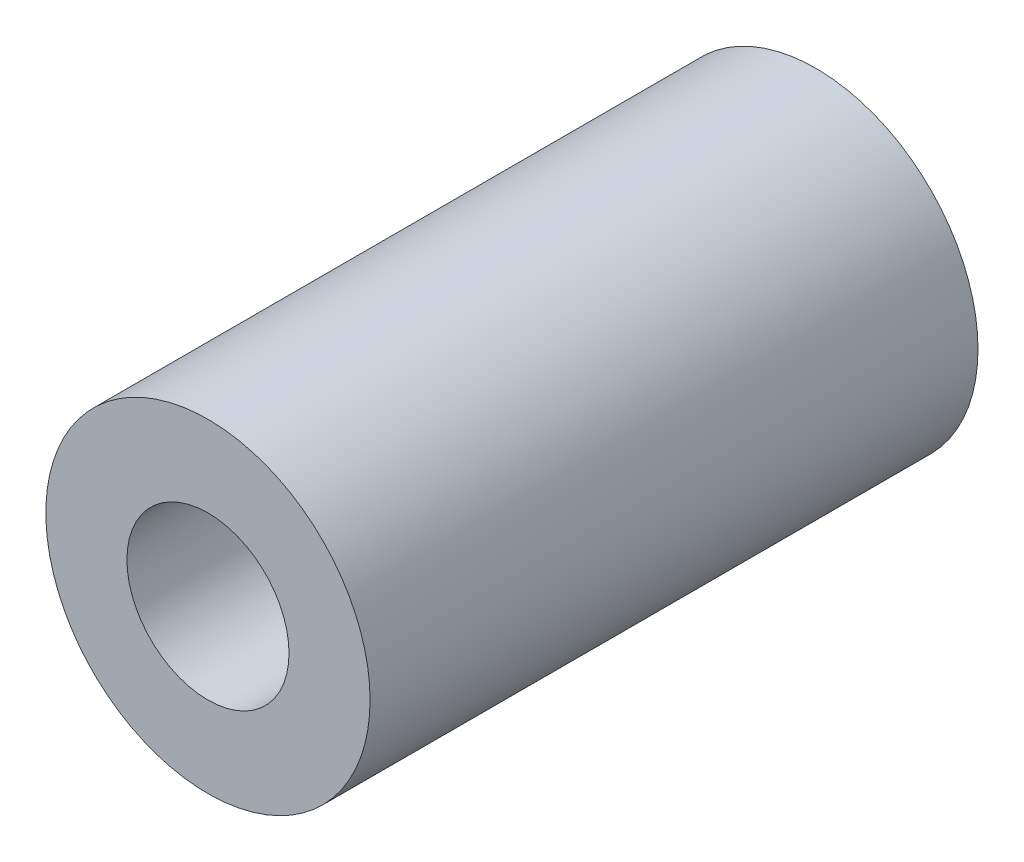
ISO-10303-21;
HEADER;
FILE_DESCRIPTION(('STEP AP214'),'2;1');
FILE_NAME('part.step','',(''),(''),'','','');
FILE_SCHEMA(('AUTOMOTIVE_DESIGN { 1 0 10303 214 1 1 1 1 }'));
ENDSEC;
DATA;
#1=APPLICATION_CONTEXT('core data for automotive mechanical design processes');
#2=APPLICATION_PROTOCOL_DEFINITION('international standard','automotive_design',2000,#1);
#3=PRODUCT_CONTEXT('',#1,'mechanical');
#4=PRODUCT('Part','Part','',(#3));
#5=PRODUCT_RELATED_PRODUCT_CATEGORY('part','',(#4));
#6=PRODUCT_DEFINITION_FORMATION('','',#4);
#7=PRODUCT_DEFINITION_CONTEXT('part definition',#1,'design');
#8=PRODUCT_DEFINITION('design','',#6,#7);
#9=PRODUCT_DEFINITION_SHAPE('','',#8);
#10=(LENGTH_UNIT() NAMED_UNIT(*) SI_UNIT(.MILLI.,.METRE.));
#11=(NAMED_UNIT(*) PLANE_ANGLE_UNIT() SI_UNIT($,.RADIAN.));
#12=(NAMED_UNIT(*) SI_UNIT($,.STERADIAN.) SOLID_ANGLE_UNIT());
#13=UNCERTAINTY_MEASURE_WITH_UNIT(LENGTH_MEASURE(1.E-05),#10,'distance_accuracy_value','');
#14=(GEOMETRIC_REPRESENTATION_CONTEXT(3) GLOBAL_UNCERTAINTY_ASSIGNED_CONTEXT((#13)) GLOBAL_UNIT_ASSIGNED_CONTEXT((#10,
#11,#12)) REPRESENTATION_CONTEXT('',''));
#15=CARTESIAN_POINT('',(0.,0.,0.));
#16=DIRECTION('',(0.,0.,1.));
#17=DIRECTION('',(1.,0.,0.));
#18=AXIS2_PLACEMENT_3D('',#15,#16,#17);
#19=CARTESIAN_POINT('',(0.,0.,40.));
#20=DIRECTION('',(0.,0.,1.));
#21=DIRECTION('',(1.,0.,0.));
#22=AXIS2_PLACEMENT_3D('',#19,#20,#21);
#23=CYLINDRICAL_SURFACE('',#22,6.);
#24=CARTESIAN_POINT('',(0.,0.,0.));
#25=DIRECTION('',(0.,0.,1.));
#26=DIRECTION('',(1.,0.,0.));
#27=AXIS2_PLACEMENT_3D('',#24,#25,#26);
#28=CIRCLE('',#27,6.);
#29=CARTESIAN_POINT('',(6.,0.,0.));
#30=VERTEX_POINT('',#29);
#31=EDGE_CURVE('E8',#30,#30,#28,.T.);
#32=ORIENTED_EDGE('',*,*,#31,.F.);
#33=EDGE_LOOP('',(#32));
#34=FACE_BOUND('',#33,.T.);
#35=CARTESIAN_POINT('',(0.,0.,12.));
#36=DIRECTION('',(0.,0.,1.));
#37=DIRECTION('',(1.,0.,0.));
#38=AXIS2_PLACEMENT_3D('',#35,#36,#37);
#39=CIRCLE('',#38,6.);
#40=CARTESIAN_POINT('',(6.,0.,12.));
#41=VERTEX_POINT('',#40);
#42=EDGE_CURVE('E34',#41,#41,#39,.T.);
#43=ORIENTED_EDGE('',*,*,#42,.T.);
#44=EDGE_LOOP('',(#43));
#45=FACE_BOUND('',#44,.T.);
#46=ADVANCED_FACE('F12',(#34,#45),#23,.F.);
#47=CARTESIAN_POINT('',(6.,0.,0.));
#48=DIRECTION('',(0.,0.,1.));
#49=DIRECTION('',(1.,0.,0.));
#50=AXIS2_PLACEMENT_3D('',#47,#48,#49);
#51=PLANE('',#50);
#52=CARTESIAN_POINT('',(0.,0.,0.));
#53=DIRECTION('',(0.,0.,1.));
#54=DIRECTION('',(1.,0.,0.));
#55=AXIS2_PLACEMENT_3D('',#52,#53,#54);
#56=CIRCLE('',#55,20.);
#57=CARTESIAN_POINT('',(20.,0.,0.));
#58=VERTEX_POINT('',#57);
#59=EDGE_CURVE('E18',#58,#58,#56,.T.);
#60=ORIENTED_EDGE('',*,*,#59,.F.);
#61=EDGE_LOOP('',(#60));
#62=FACE_BOUND('',#61,.T.);
#63=ORIENTED_EDGE('',*,*,#31,.T.);
#64=EDGE_LOOP('',(#63));
#65=FACE_BOUND('',#64,.T.);
#66=ADVANCED_FACE('F59',(#62,#65),#51,.F.);
#67=CARTESIAN_POINT('',(0.,0.,40.));
#68=DIRECTION('',(0.,0.,1.));
#69=DIRECTION('',(1.,0.,0.));
#70=AXIS2_PLACEMENT_3D('',#67,#68,#69);
#71=CYLINDRICAL_SURFACE('',#70,20.);
#72=CARTESIAN_POINT('',(0.,0.,75.));
#73=DIRECTION('',(0.,0.,1.));
#74=DIRECTION('',(1.,0.,0.));
#75=AXIS2_PLACEMENT_3D('',#72,#73,#74);
#76=CIRCLE('',#75,20.);
#77=CARTESIAN_POINT('',(20.,0.,75.));
#78=VERTEX_POINT('',#77);
#79=EDGE_CURVE('E22',#78,#78,#76,.T.);
#80=ORIENTED_EDGE('',*,*,#79,.F.);
#81=EDGE_LOOP('',(#80));
#82=FACE_BOUND('',#81,.T.);
#83=ORIENTED_EDGE('',*,*,#59,.T.);
#84=EDGE_LOOP('',(#83));
#85=FACE_BOUND('',#84,.T.);
#86=ADVANCED_FACE('F54',(#82,#85),#71,.T.);
#87=CARTESIAN_POINT('',(20.,0.,75.));
#88=DIRECTION('',(0.,0.,-1.));
#89=DIRECTION('',(-1.,0.,0.));
#90=AXIS2_PLACEMENT_3D('',#87,#88,#89);
#91=PLANE('',#90);
#92=CARTESIAN_POINT('',(0.,0.,75.));
#93=DIRECTION('',(0.,0.,1.));
#94=DIRECTION('',(1.,0.,0.));
#95=AXIS2_PLACEMENT_3D('',#92,#93,#94);
#96=CIRCLE('',#95,10.);
#97=CARTESIAN_POINT('',(10.,0.,75.));
#98=VERTEX_POINT('',#97);
#99=EDGE_CURVE('E26',#98,#98,#96,.T.);
#100=ORIENTED_EDGE('',*,*,#99,.F.);
#101=EDGE_LOOP('',(#100));
#102=FACE_BOUND('',#101,.T.);
#103=ORIENTED_EDGE('',*,*,#79,.T.);
#104=EDGE_LOOP('',(#103));
#105=FACE_BOUND('',#104,.T.);
#106=ADVANCED_FACE('F48',(#102,#105),#91,.F.);
#107=CARTESIAN_POINT('',(0.,0.,40.));
#108=DIRECTION('',(0.,0.,1.));
#109=DIRECTION('',(1.,0.,0.));
#110=AXIS2_PLACEMENT_3D('',#107,#108,#109);
#111=CYLINDRICAL_SURFACE('',#110,10.);
#112=CARTESIAN_POINT('',(0.,0.,12.));
#113=DIRECTION('',(0.,0.,1.));
#114=DIRECTION('',(1.,0.,0.));
#115=AXIS2_PLACEMENT_3D('',#112,#113,#114);
#116=CIRCLE('',#115,10.);
#117=CARTESIAN_POINT('',(10.,0.,12.));
#118=VERTEX_POINT('',#117);
#119=EDGE_CURVE('E31',#118,#118,#116,.T.);
#120=ORIENTED_EDGE('',*,*,#119,.F.);
#121=EDGE_LOOP('',(#120));
#122=FACE_BOUND('',#121,.T.);
#123=ORIENTED_EDGE('',*,*,#99,.T.);
#124=EDGE_LOOP('',(#123));
#125=FACE_BOUND('',#124,.T.);
#126=ADVANCED_FACE('F42',(#122,#125),#111,.F.);
#127=CARTESIAN_POINT('',(10.,0.,12.));
#128=DIRECTION('',(0.,0.,-1.));
#129=DIRECTION('',(-1.,0.,0.));
#130=AXIS2_PLACEMENT_3D('',#127,#128,#129);
#131=PLANE('',#130);
#132=ORIENTED_EDGE('',*,*,#42,.F.);
#133=EDGE_LOOP('',(#132));
#134=FACE_BOUND('',#133,.T.);
#135=ORIENTED_EDGE('',*,*,#119,.T.);
#136=EDGE_LOOP('',(#135));
#137=FACE_BOUND('',#136,.T.);
#138=ADVANCED_FACE('F39',(#134,#137),#131,.F.);
#139=CLOSED_SHELL('',(#46,#66,#86,#106,#126,#138));
#140=MANIFOLD_SOLID_BREP('B1',#139);
#141=ADVANCED_BREP_SHAPE_REPRESENTATION('',(#18,#140),#14);
#142=SHAPE_DEFINITION_REPRESENTATION(#9,#141);
ENDSEC;
END-ISO-10303-21;
